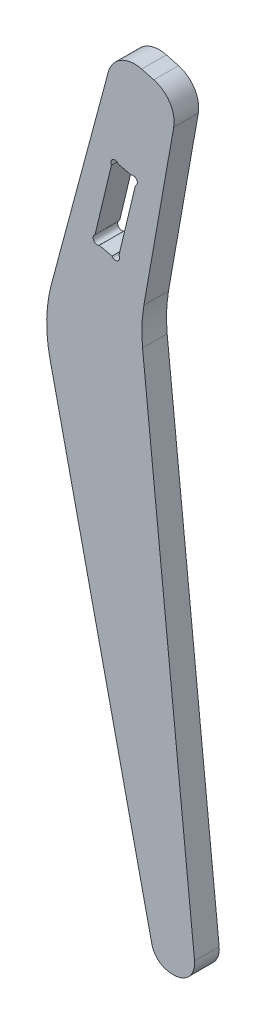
ISO-10303-21;
HEADER;
FILE_DESCRIPTION(('STEP AP214'),'2;1');
FILE_NAME('part.step','',(''),(''),'','','');
FILE_SCHEMA(('AUTOMOTIVE_DESIGN { 1 0 10303 214 1 1 1 1 }'));
ENDSEC;
DATA;
#1=APPLICATION_CONTEXT('core data for automotive mechanical design processes');
#2=APPLICATION_PROTOCOL_DEFINITION('international standard','automotive_design',2000,#1);
#3=PRODUCT_CONTEXT('',#1,'mechanical');
#4=PRODUCT('Part','Part','',(#3));
#5=PRODUCT_RELATED_PRODUCT_CATEGORY('part','',(#4));
#6=PRODUCT_DEFINITION_FORMATION('','',#4);
#7=PRODUCT_DEFINITION_CONTEXT('part definition',#1,'design');
#8=PRODUCT_DEFINITION('design','',#6,#7);
#9=PRODUCT_DEFINITION_SHAPE('','',#8);
#10=(LENGTH_UNIT() NAMED_UNIT(*) SI_UNIT(.MILLI.,.METRE.));
#11=(NAMED_UNIT(*) PLANE_ANGLE_UNIT() SI_UNIT($,.RADIAN.));
#12=(NAMED_UNIT(*) SI_UNIT($,.STERADIAN.) SOLID_ANGLE_UNIT());
#13=UNCERTAINTY_MEASURE_WITH_UNIT(LENGTH_MEASURE(1.E-05),#10,'distance_accuracy_value','');
#14=(GEOMETRIC_REPRESENTATION_CONTEXT(3) GLOBAL_UNCERTAINTY_ASSIGNED_CONTEXT((#13)) GLOBAL_UNIT_ASSIGNED_CONTEXT((#10,
#11,#12)) REPRESENTATION_CONTEXT('',''));
#15=CARTESIAN_POINT('',(0.,0.,0.));
#16=DIRECTION('',(0.,0.,1.));
#17=DIRECTION('',(1.,0.,0.));
#18=AXIS2_PLACEMENT_3D('',#15,#16,#17);
#19=CARTESIAN_POINT('',(41.8004742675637,156.001493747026,18.));
#20=DIRECTION('',(0.258819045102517,0.965925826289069,0.));
#21=DIRECTION('',(-0.965925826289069,0.258819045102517,0.));
#22=AXIS2_PLACEMENT_3D('',#19,#20,#21);
#23=PLANE('',#22);
#24=DIRECTION('',(0.965925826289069,-0.258819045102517,0.));
#25=VECTOR('',#24,1.);
#26=CARTESIAN_POINT('',(41.8004742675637,156.001493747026,0.));
#27=LINE('',#26,#25);
#28=CARTESIAN_POINT('',(213.825932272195,109.907411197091,0.));
#29=VERTEX_POINT('',#28);
#30=CARTESIAN_POINT('',(222.668724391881,107.537992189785,0.));
#31=VERTEX_POINT('',#30);
#32=EDGE_CURVE('E216',#29,#31,#27,.T.);
#33=ORIENTED_EDGE('',*,*,#32,.F.);
#34=DIRECTION('',(0.,0.,-1.));
#35=VECTOR('',#34,1.);
#36=CARTESIAN_POINT('',(213.825932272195,109.907411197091,18.));
#37=LINE('',#36,#35);
#38=CARTESIAN_POINT('',(213.825932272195,109.907411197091,18.));
#39=VERTEX_POINT('',#38);
#40=EDGE_CURVE('E246',#39,#29,#37,.T.);
#41=ORIENTED_EDGE('',*,*,#40,.F.);
#42=DIRECTION('',(0.965925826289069,-0.258819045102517,0.));
#43=VECTOR('',#42,1.);
#44=CARTESIAN_POINT('',(41.8004742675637,156.001493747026,18.));
#45=LINE('',#44,#43);
#46=CARTESIAN_POINT('',(222.668724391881,107.537992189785,18.));
#47=VERTEX_POINT('',#46);
#48=EDGE_CURVE('E329',#39,#47,#45,.T.);
#49=ORIENTED_EDGE('',*,*,#48,.T.);
#50=DIRECTION('',(0.,0.,-1.));
#51=VECTOR('',#50,1.);
#52=CARTESIAN_POINT('',(222.668724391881,107.537992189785,18.));
#53=LINE('',#52,#51);
#54=EDGE_CURVE('E239',#47,#31,#53,.T.);
#55=ORIENTED_EDGE('',*,*,#54,.T.);
#56=EDGE_LOOP('',(#33,#41,#49,#55));
#57=FACE_BOUND('',#56,.T.);
#58=ADVANCED_FACE('F35',(#57),#23,.T.);
#59=CARTESIAN_POINT('',(208.649551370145,90.5888946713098,18.));
#60=DIRECTION('',(0.,0.,-1.));
#61=DIRECTION('',(-1.,0.,0.));
#62=AXIS2_PLACEMENT_3D('',#59,#60,#61);
#63=CYLINDRICAL_SURFACE('',#62,20.);
#64=CARTESIAN_POINT('',(208.649551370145,90.5888946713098,0.));
#65=DIRECTION('',(0.,0.,1.));
#66=DIRECTION('',(1.,0.,0.));
#67=AXIS2_PLACEMENT_3D('',#64,#65,#66);
#68=CIRCLE('',#67,20.);
#69=CARTESIAN_POINT('',(189.331034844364,95.7652755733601,0.));
#70=VERTEX_POINT('',#69);
#71=EDGE_CURVE('E219',#29,#70,#68,.T.);
#72=ORIENTED_EDGE('',*,*,#71,.T.);
#73=DIRECTION('',(0.,0.,-1.));
#74=VECTOR('',#73,1.);
#75=CARTESIAN_POINT('',(189.331034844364,95.7652755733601,18.));
#76=LINE('',#75,#74);
#77=CARTESIAN_POINT('',(189.331034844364,95.7652755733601,18.));
#78=VERTEX_POINT('',#77);
#79=EDGE_CURVE('E243',#78,#70,#76,.T.);
#80=ORIENTED_EDGE('',*,*,#79,.F.);
#81=CARTESIAN_POINT('',(208.649551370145,90.5888946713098,18.));
#82=DIRECTION('',(0.,0.,1.));
#83=DIRECTION('',(1.,0.,0.));
#84=AXIS2_PLACEMENT_3D('',#81,#82,#83);
#85=CIRCLE('',#84,20.);
#86=EDGE_CURVE('E346',#39,#78,#85,.T.);
#87=ORIENTED_EDGE('',*,*,#86,.F.);
#88=ORIENTED_EDGE('',*,*,#40,.T.);
#89=EDGE_LOOP('',(#72,#80,#87,#88));
#90=FACE_BOUND('',#89,.T.);
#91=ADVANCED_FACE('F323',(#90),#63,.T.);
#92=CARTESIAN_POINT('',(152.70694147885,-40.917701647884,18.));
#93=DIRECTION('',(0.965925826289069,-0.258819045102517,0.));
#94=DIRECTION('',(0.258819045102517,0.965925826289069,0.));
#95=AXIS2_PLACEMENT_3D('',#92,#93,#94);
#96=PLANE('',#95);
#97=DIRECTION('',(-0.258819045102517,-0.965925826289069,0.));
#98=VECTOR('',#97,1.);
#99=CARTESIAN_POINT('',(152.70694147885,-40.917701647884,0.));
#100=LINE('',#99,#98);
#101=CARTESIAN_POINT('',(147.725808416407,-59.5075433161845,0.));
#102=VERTEX_POINT('',#101);
#103=EDGE_CURVE('E222',#70,#102,#100,.T.);
#104=ORIENTED_EDGE('',*,*,#103,.T.);
#105=DIRECTION('',(0.,0.,-1.));
#106=VECTOR('',#105,1.);
#107=CARTESIAN_POINT('',(147.725808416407,-59.5075433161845,18.));
#108=LINE('',#107,#106);
#109=CARTESIAN_POINT('',(147.725808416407,-59.5075433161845,18.));
#110=VERTEX_POINT('',#109);
#111=EDGE_CURVE('E253',#102,#110,#108,.F.);
#112=ORIENTED_EDGE('',*,*,#111,.T.);
#113=DIRECTION('',(-0.258819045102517,-0.965925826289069,0.));
#114=VECTOR('',#113,1.);
#115=CARTESIAN_POINT('',(152.70694147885,-40.917701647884,18.));
#116=LINE('',#115,#114);
#117=EDGE_CURVE('E319',#78,#110,#116,.T.);
#118=ORIENTED_EDGE('',*,*,#117,.F.);
#119=ORIENTED_EDGE('',*,*,#79,.T.);
#120=EDGE_LOOP('',(#104,#112,#118,#119));
#121=FACE_BOUND('',#120,.T.);
#122=ADVANCED_FACE('F316',(#121),#96,.F.);
#123=CARTESIAN_POINT('',(116.93444675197,26.1283123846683,18.));
#124=DIRECTION('',(-0.975933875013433,-0.218066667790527,0.));
#125=DIRECTION('',(0.218066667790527,-0.975933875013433,0.));
#126=AXIS2_PLACEMENT_3D('',#123,#124,#125);
#127=PLANE('',#126);
#128=DIRECTION('',(-0.218066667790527,0.975933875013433,0.));
#129=VECTOR('',#128,1.);
#130=CARTESIAN_POINT('',(116.93444675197,26.1283123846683,0.));
#131=LINE('',#130,#129);
#132=CARTESIAN_POINT('',(221.1771415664,-440.39863610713,0.));
#133=VERTEX_POINT('',#132);
#134=CARTESIAN_POINT('',(146.725003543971,-107.196114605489,0.));
#135=VERTEX_POINT('',#134);
#136=EDGE_CURVE('E225',#133,#135,#131,.T.);
#137=ORIENTED_EDGE('',*,*,#136,.F.);
#138=DIRECTION('',(0.,0.,-1.));
#139=VECTOR('',#138,1.);
#140=CARTESIAN_POINT('',(221.1771415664,-440.39863610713,18.));
#141=LINE('',#140,#139);
#142=CARTESIAN_POINT('',(221.1771415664,-440.39863610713,18.));
#143=VERTEX_POINT('',#142);
#144=EDGE_CURVE('E11',#133,#143,#141,.F.);
#145=ORIENTED_EDGE('',*,*,#144,.T.);
#146=DIRECTION('',(-0.218066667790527,0.975933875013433,0.));
#147=VECTOR('',#146,1.);
#148=CARTESIAN_POINT('',(116.93444675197,26.1283123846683,18.));
#149=LINE('',#148,#147);
#150=CARTESIAN_POINT('',(146.725003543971,-107.196114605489,18.));
#151=VERTEX_POINT('',#150);
#152=EDGE_CURVE('E309',#143,#151,#149,.T.);
#153=ORIENTED_EDGE('',*,*,#152,.T.);
#154=DIRECTION('',(0.,0.,-1.));
#155=VECTOR('',#154,1.);
#156=CARTESIAN_POINT('',(146.725003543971,-107.196114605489,0.));
#157=LINE('',#156,#155);
#158=EDGE_CURVE('E248',#151,#135,#157,.T.);
#159=ORIENTED_EDGE('',*,*,#158,.T.);
#160=EDGE_LOOP('',(#137,#145,#153,#159));
#161=FACE_BOUND('',#160,.T.);
#162=ADVANCED_FACE('F307',(#161),#127,.T.);
#163=CARTESIAN_POINT('',(0.,-452.127636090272,18.));
#164=DIRECTION('',(0.,-1.,0.));
#165=DIRECTION('',(0.,0.,-1.));
#166=AXIS2_PLACEMENT_3D('',#163,#164,#165);
#167=PLANE('',#166);
#168=DIRECTION('',(-1.,0.,0.));
#169=VECTOR('',#168,1.);
#170=CARTESIAN_POINT('',(0.,-452.127636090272,0.));
#171=LINE('',#170,#169);
#172=CARTESIAN_POINT('',(237.524308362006,-452.127636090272,0.));
#173=VERTEX_POINT('',#172);
#174=CARTESIAN_POINT('',(235.816149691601,-452.127636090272,0.));
#175=VERTEX_POINT('',#174);
#176=EDGE_CURVE('E227',#173,#175,#171,.T.);
#177=ORIENTED_EDGE('',*,*,#176,.F.);
#178=DIRECTION('',(0.,0.,-1.));
#179=VECTOR('',#178,1.);
#180=CARTESIAN_POINT('',(237.524308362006,-452.127636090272,18.));
#181=LINE('',#180,#179);
#182=CARTESIAN_POINT('',(237.524308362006,-452.127636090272,18.));
#183=VERTEX_POINT('',#182);
#184=EDGE_CURVE('E282',#173,#183,#181,.F.);
#185=ORIENTED_EDGE('',*,*,#184,.T.);
#186=DIRECTION('',(-1.,0.,0.));
#187=VECTOR('',#186,1.);
#188=CARTESIAN_POINT('',(0.,-452.127636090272,18.));
#189=LINE('',#188,#187);
#190=CARTESIAN_POINT('',(235.816149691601,-452.127636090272,18.));
#191=VERTEX_POINT('',#190);
#192=EDGE_CURVE('E290',#183,#191,#189,.T.);
#193=ORIENTED_EDGE('',*,*,#192,.T.);
#194=DIRECTION('',(0.,0.,-1.));
#195=VECTOR('',#194,1.);
#196=CARTESIAN_POINT('',(235.816149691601,-452.127636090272,18.));
#197=LINE('',#196,#195);
#198=EDGE_CURVE('E279',#191,#175,#197,.T.);
#199=ORIENTED_EDGE('',*,*,#198,.T.);
#200=EDGE_LOOP('',(#177,#185,#193,#199));
#201=FACE_BOUND('',#200,.T.);
#202=ADVANCED_FACE('F303',(#201),#167,.T.);
#203=CARTESIAN_POINT('',(205.380018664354,21.1630051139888,18.));
#204=DIRECTION('',(0.994732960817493,0.10250042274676,0.));
#205=DIRECTION('',(-0.10250042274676,0.994732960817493,0.));
#206=AXIS2_PLACEMENT_3D('',#203,#204,#205);
#207=PLANE('',#206);
#208=DIRECTION('',(0.10250042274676,-0.994732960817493,0.));
#209=VECTOR('',#208,1.);
#210=CARTESIAN_POINT('',(205.380018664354,21.1630051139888,18.));
#211=LINE('',#210,#209);
#212=CARTESIAN_POINT('',(214.406928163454,-66.4401888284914,18.));
#213=VERTEX_POINT('',#212);
#214=CARTESIAN_POINT('',(252.445302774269,-435.590129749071,18.));
#215=VERTEX_POINT('',#214);
#216=EDGE_CURVE('E288',#213,#215,#211,.T.);
#217=ORIENTED_EDGE('',*,*,#216,.T.);
#218=DIRECTION('',(0.,0.,-1.));
#219=VECTOR('',#218,1.);
#220=CARTESIAN_POINT('',(252.445302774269,-435.590129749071,18.));
#221=LINE('',#220,#219);
#222=CARTESIAN_POINT('',(252.445302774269,-435.590129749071,0.));
#223=VERTEX_POINT('',#222);
#224=EDGE_CURVE('E272',#215,#223,#221,.T.);
#225=ORIENTED_EDGE('',*,*,#224,.T.);
#226=DIRECTION('',(0.10250042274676,-0.994732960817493,0.));
#227=VECTOR('',#226,1.);
#228=CARTESIAN_POINT('',(205.380018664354,21.1630051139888,0.));
#229=LINE('',#228,#227);
#230=CARTESIAN_POINT('',(214.406928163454,-66.4401888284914,0.));
#231=VERTEX_POINT('',#230);
#232=EDGE_CURVE('E230',#231,#223,#229,.T.);
#233=ORIENTED_EDGE('',*,*,#232,.F.);
#234=DIRECTION('',(0.,0.,-1.));
#235=VECTOR('',#234,1.);
#236=CARTESIAN_POINT('',(214.406928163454,-66.4401888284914,18.));
#237=LINE('',#236,#235);
#238=EDGE_CURVE('E261',#231,#213,#237,.F.);
#239=ORIENTED_EDGE('',*,*,#238,.T.);
#240=EDGE_LOOP('',(#217,#225,#233,#239));
#241=FACE_BOUND('',#240,.T.);
#242=ADVANCED_FACE('F295',(#241),#207,.T.);
#243=CARTESIAN_POINT('',(215.543883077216,-38.0062021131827,18.));
#244=DIRECTION('',(0.984807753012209,-0.173648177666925,0.));
#245=DIRECTION('',(0.173648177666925,0.984807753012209,0.));
#246=AXIS2_PLACEMENT_3D('',#243,#244,#245);
#247=PLANE('',#246);
#248=DIRECTION('',(-0.173648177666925,-0.984807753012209,0.));
#249=VECTOR('',#248,1.);
#250=CARTESIAN_POINT('',(215.543883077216,-38.0062021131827,18.));
#251=LINE('',#250,#249);
#252=CARTESIAN_POINT('',(237.188498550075,84.7465121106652,18.));
#253=VERTEX_POINT('',#252);
#254=CARTESIAN_POINT('',(215.399448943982,-38.8253287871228,18.));
#255=VERTEX_POINT('',#254);
#256=EDGE_CURVE('E298',#253,#255,#251,.T.);
#257=ORIENTED_EDGE('',*,*,#256,.T.);
#258=DIRECTION('',(0.,0.,-1.));
#259=VECTOR('',#258,1.);
#260=CARTESIAN_POINT('',(215.399448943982,-38.8253287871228,0.));
#261=LINE('',#260,#259);
#262=CARTESIAN_POINT('',(215.399448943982,-38.8253287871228,0.));
#263=VERTEX_POINT('',#262);
#264=EDGE_CURVE('E258',#255,#263,#261,.T.);
#265=ORIENTED_EDGE('',*,*,#264,.T.);
#266=DIRECTION('',(-0.173648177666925,-0.984807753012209,0.));
#267=VECTOR('',#266,1.);
#268=CARTESIAN_POINT('',(215.543883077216,-38.0062021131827,0.));
#269=LINE('',#268,#267);
#270=CARTESIAN_POINT('',(237.188498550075,84.7465121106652,0.));
#271=VERTEX_POINT('',#270);
#272=EDGE_CURVE('E233',#271,#263,#269,.T.);
#273=ORIENTED_EDGE('',*,*,#272,.F.);
#274=DIRECTION('',(0.,0.,-1.));
#275=VECTOR('',#274,1.);
#276=CARTESIAN_POINT('',(237.188498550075,84.7465121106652,18.));
#277=LINE('',#276,#275);
#278=EDGE_CURVE('E241',#253,#271,#277,.T.);
#279=ORIENTED_EDGE('',*,*,#278,.F.);
#280=EDGE_LOOP('',(#257,#265,#273,#279));
#281=FACE_BOUND('',#280,.T.);
#282=ADVANCED_FACE('F337',(#281),#247,.T.);
#283=CARTESIAN_POINT('',(19.9991991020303,83.5068127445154,18.));
#284=DIRECTION('',(0.232905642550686,0.97249933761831,0.));
#285=DIRECTION('',(-0.97249933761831,0.232905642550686,0.));
#286=AXIS2_PLACEMENT_3D('',#283,#284,#285);
#287=PLANE('',#286);
#288=DIRECTION('',(0.97249933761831,-0.232905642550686,0.));
#289=VECTOR('',#288,1.);
#290=CARTESIAN_POINT('',(19.9991991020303,83.5068127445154,0.));
#291=LINE('',#290,#289);
#292=CARTESIAN_POINT('',(196.781458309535,41.1689066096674,0.));
#293=VERTEX_POINT('',#292);
#294=CARTESIAN_POINT('',(206.034515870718,38.9528749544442,0.));
#295=VERTEX_POINT('',#294);
#296=EDGE_CURVE('E190',#293,#295,#291,.T.);
#297=ORIENTED_EDGE('',*,*,#296,.T.);
#298=DIRECTION('',(0.,0.,1.));
#299=VECTOR('',#298,1.);
#300=CARTESIAN_POINT('',(206.034515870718,38.9528749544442,0.));
#301=LINE('',#300,#299);
#302=CARTESIAN_POINT('',(206.034515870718,38.9528749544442,18.));
#303=VERTEX_POINT('',#302);
#304=EDGE_CURVE('E367',#295,#303,#301,.T.);
#305=ORIENTED_EDGE('',*,*,#304,.T.);
#306=DIRECTION('',(0.97249933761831,-0.232905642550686,0.));
#307=VECTOR('',#306,1.);
#308=CARTESIAN_POINT('',(19.9991991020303,83.5068127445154,18.));
#309=LINE('',#308,#307);
#310=CARTESIAN_POINT('',(196.781458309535,41.1689066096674,18.));
#311=VERTEX_POINT('',#310);
#312=EDGE_CURVE('E192',#311,#303,#309,.T.);
#313=ORIENTED_EDGE('',*,*,#312,.F.);
#314=DIRECTION('',(0.,0.,1.));
#315=VECTOR('',#314,1.);
#316=CARTESIAN_POINT('',(196.781458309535,41.1689066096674,0.));
#317=LINE('',#316,#315);
#318=EDGE_CURVE('E174',#311,#293,#317,.F.);
#319=ORIENTED_EDGE('',*,*,#318,.T.);
#320=EDGE_LOOP('',(#297,#305,#313,#319));
#321=FACE_BOUND('',#320,.T.);
#322=ADVANCED_FACE('F188',(#321),#287,.F.);
#323=CARTESIAN_POINT('',(190.161282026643,-45.5420727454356,18.));
#324=DIRECTION('',(0.972499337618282,-0.232905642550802,0.));
#325=DIRECTION('',(0.232905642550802,0.972499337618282,0.));
#326=AXIS2_PLACEMENT_3D('',#323,#324,#325);
#327=PLANE('',#326);
#328=DIRECTION('',(-0.232905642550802,-0.972499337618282,0.));
#329=VECTOR('',#328,1.);
#330=CARTESIAN_POINT('',(190.161282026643,-45.5420727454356,0.));
#331=LINE('',#330,#329);
#332=CARTESIAN_POINT('',(209.172346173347,33.8387747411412,0.));
#333=VERTEX_POINT('',#332);
#334=CARTESIAN_POINT('',(197.174277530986,-16.2592550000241,0.));
#335=VERTEX_POINT('',#334);
#336=EDGE_CURVE('E199',#333,#335,#331,.T.);
#337=ORIENTED_EDGE('',*,*,#336,.T.);
#338=DIRECTION('',(0.,0.,1.));
#339=VECTOR('',#338,1.);
#340=CARTESIAN_POINT('',(197.174277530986,-16.2592550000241,0.));
#341=LINE('',#340,#339);
#342=CARTESIAN_POINT('',(197.174277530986,-16.2592550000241,18.));
#343=VERTEX_POINT('',#342);
#344=EDGE_CURVE('E361',#335,#343,#341,.T.);
#345=ORIENTED_EDGE('',*,*,#344,.T.);
#346=DIRECTION('',(-0.232905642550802,-0.972499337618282,0.));
#347=VECTOR('',#346,1.);
#348=CARTESIAN_POINT('',(190.161282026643,-45.5420727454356,18.));
#349=LINE('',#348,#347);
#350=CARTESIAN_POINT('',(209.172346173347,33.8387747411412,18.));
#351=VERTEX_POINT('',#350);
#352=EDGE_CURVE('E355',#351,#343,#349,.T.);
#353=ORIENTED_EDGE('',*,*,#352,.F.);
#354=DIRECTION('',(0.,0.,1.));
#355=VECTOR('',#354,1.);
#356=CARTESIAN_POINT('',(209.172346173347,33.8387747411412,0.));
#357=LINE('',#356,#355);
#358=EDGE_CURVE('E193',#351,#333,#357,.F.);
#359=ORIENTED_EDGE('',*,*,#358,.T.);
#360=EDGE_LOOP('',(#337,#345,#353,#359));
#361=FACE_BOUND('',#360,.T.);
#362=ADVANCED_FACE('F399',(#361),#327,.F.);
#363=CARTESIAN_POINT('',(6.02486054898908,25.1568524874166,18.));
#364=DIRECTION('',(0.232905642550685,0.97249933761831,0.));
#365=DIRECTION('',(-0.972499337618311,0.232905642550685,0.));
#366=AXIS2_PLACEMENT_3D('',#363,#364,#365);
#367=PLANE('',#366);
#368=DIRECTION('',(0.,0.,1.));
#369=VECTOR('',#368,1.);
#370=CARTESIAN_POINT('',(182.807119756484,-17.1810536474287,0.));
#371=LINE('',#370,#369);
#372=CARTESIAN_POINT('',(182.807119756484,-17.1810536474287,18.));
#373=VERTEX_POINT('',#372);
#374=CARTESIAN_POINT('',(182.807119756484,-17.1810536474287,0.));
#375=VERTEX_POINT('',#374);
#376=EDGE_CURVE('E200',#373,#375,#371,.F.);
#377=ORIENTED_EDGE('',*,*,#376,.F.);
#378=DIRECTION('',(0.972499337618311,-0.232905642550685,0.));
#379=VECTOR('',#378,1.);
#380=CARTESIAN_POINT('',(6.02486054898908,25.1568524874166,18.));
#381=LINE('',#380,#379);
#382=CARTESIAN_POINT('',(192.06017731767,-19.3970853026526,18.));
#383=VERTEX_POINT('',#382);
#384=EDGE_CURVE('E352',#373,#383,#381,.T.);
#385=ORIENTED_EDGE('',*,*,#384,.T.);
#386=DIRECTION('',(0.,0.,1.));
#387=VECTOR('',#386,1.);
#388=CARTESIAN_POINT('',(192.06017731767,-19.3970853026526,0.));
#389=LINE('',#388,#387);
#390=CARTESIAN_POINT('',(192.06017731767,-19.3970853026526,0.));
#391=VERTEX_POINT('',#390);
#392=EDGE_CURVE('E364',#391,#383,#389,.T.);
#393=ORIENTED_EDGE('',*,*,#392,.F.);
#394=DIRECTION('',(0.972499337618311,-0.232905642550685,0.));
#395=VECTOR('',#394,1.);
#396=CARTESIAN_POINT('',(6.02486054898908,25.1568524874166,0.));
#397=LINE('',#396,#395);
#398=EDGE_CURVE('E203',#375,#391,#397,.T.);
#399=ORIENTED_EDGE('',*,*,#398,.F.);
#400=EDGE_LOOP('',(#377,#385,#393,#399));
#401=FACE_BOUND('',#400,.T.);
#402=ADVANCED_FACE('F395',(#401),#367,.T.);
#403=CARTESIAN_POINT('',(172.656293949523,-41.34977117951,18.));
#404=DIRECTION('',(0.972499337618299,-0.232905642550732,0.));
#405=DIRECTION('',(0.232905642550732,0.972499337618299,0.));
#406=AXIS2_PLACEMENT_3D('',#403,#404,#405);
#407=PLANE('',#406);
#408=DIRECTION('',(0.,0.,1.));
#409=VECTOR('',#408,1.);
#410=CARTESIAN_POINT('',(179.669289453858,-12.0669534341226,0.));
#411=LINE('',#410,#409);
#412=CARTESIAN_POINT('',(179.669289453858,-12.0669534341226,0.));
#413=VERTEX_POINT('',#412);
#414=CARTESIAN_POINT('',(179.669289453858,-12.0669534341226,18.));
#415=VERTEX_POINT('',#414);
#416=EDGE_CURVE('E206',#413,#415,#411,.T.);
#417=ORIENTED_EDGE('',*,*,#416,.F.);
#418=DIRECTION('',(-0.232905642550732,-0.972499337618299,0.));
#419=VECTOR('',#418,1.);
#420=CARTESIAN_POINT('',(172.656293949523,-41.34977117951,0.));
#421=LINE('',#420,#419);
#422=CARTESIAN_POINT('',(191.667358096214,38.0310763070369,0.));
#423=VERTEX_POINT('',#422);
#424=EDGE_CURVE('E214',#423,#413,#421,.T.);
#425=ORIENTED_EDGE('',*,*,#424,.F.);
#426=DIRECTION('',(0.,0.,1.));
#427=VECTOR('',#426,1.);
#428=CARTESIAN_POINT('',(191.667358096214,38.0310763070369,0.));
#429=LINE('',#428,#427);
#430=CARTESIAN_POINT('',(191.667358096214,38.0310763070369,18.));
#431=VERTEX_POINT('',#430);
#432=EDGE_CURVE('E177',#431,#423,#429,.F.);
#433=ORIENTED_EDGE('',*,*,#432,.F.);
#434=DIRECTION('',(-0.232905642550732,-0.972499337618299,0.));
#435=VECTOR('',#434,1.);
#436=CARTESIAN_POINT('',(172.656293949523,-41.34977117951,18.));
#437=LINE('',#436,#435);
#438=EDGE_CURVE('E349',#431,#415,#437,.T.);
#439=ORIENTED_EDGE('',*,*,#438,.T.);
#440=EDGE_LOOP('',(#417,#425,#433,#439));
#441=FACE_BOUND('',#440,.T.);
#442=ADVANCED_FACE('F387',(#441),#407,.T.);
#443=CARTESIAN_POINT('',(217.492343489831,88.2194756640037,18.));
#444=DIRECTION('',(0.,0.,-1.));
#445=DIRECTION('',(-1.,0.,0.));
#446=AXIS2_PLACEMENT_3D('',#443,#444,#445);
#447=CYLINDRICAL_SURFACE('',#446,20.);
#448=CARTESIAN_POINT('',(217.492343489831,88.2194756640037,0.));
#449=DIRECTION('',(0.,0.,1.));
#450=DIRECTION('',(1.,0.,0.));
#451=AXIS2_PLACEMENT_3D('',#448,#449,#450);
#452=CIRCLE('',#451,20.);
#453=EDGE_CURVE('E236',#31,#271,#452,.F.);
#454=ORIENTED_EDGE('',*,*,#453,.F.);
#455=ORIENTED_EDGE('',*,*,#54,.F.);
#456=CARTESIAN_POINT('',(217.492343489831,88.2194756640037,18.));
#457=DIRECTION('',(0.,0.,1.));
#458=DIRECTION('',(1.,0.,0.));
#459=AXIS2_PLACEMENT_3D('',#456,#457,#458);
#460=CIRCLE('',#459,20.);
#461=EDGE_CURVE('E209',#47,#253,#460,.F.);
#462=ORIENTED_EDGE('',*,*,#461,.T.);
#463=ORIENTED_EDGE('',*,*,#278,.T.);
#464=EDGE_LOOP('',(#454,#455,#462,#463));
#465=FACE_BOUND('',#464,.T.);
#466=ADVANCED_FACE('F333',(#465),#447,.T.);
#467=CARTESIAN_POINT('',(0.,0.,18.));
#468=DIRECTION('',(0.,0.,1.));
#469=DIRECTION('',(1.,0.,0.));
#470=AXIS2_PLACEMENT_3D('',#467,#468,#469);
#471=PLANE('',#470);
#472=CARTESIAN_POINT('',(181.238204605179,-14.6240035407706,18.));
#473=DIRECTION('',(0.,0.,1.));
#474=DIRECTION('',(-1.,0.,0.));
#475=AXIS2_PLACEMENT_3D('',#472,#473,#474);
#476=CIRCLE('',#475,2.99999999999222);
#477=EDGE_CURVE('E375',#415,#373,#476,.T.);
#478=ORIENTED_EDGE('',*,*,#477,.F.);
#479=ORIENTED_EDGE('',*,*,#438,.F.);
#480=CARTESIAN_POINT('',(194.224408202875,39.599991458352,18.));
#481=DIRECTION('',(0.,0.,1.));
#482=DIRECTION('',(1.,0.,0.));
#483=AXIS2_PLACEMENT_3D('',#480,#481,#482);
#484=CIRCLE('',#483,2.9999999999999);
#485=EDGE_CURVE('E372',#311,#431,#484,.T.);
#486=ORIENTED_EDGE('',*,*,#485,.F.);
#487=ORIENTED_EDGE('',*,*,#312,.T.);
#488=CARTESIAN_POINT('',(207.603431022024,36.3958248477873,18.));
#489=DIRECTION('',(0.,0.,1.));
#490=DIRECTION('',(-1.,0.,0.));
#491=AXIS2_PLACEMENT_3D('',#488,#489,#490);
#492=CIRCLE('',#491,2.99999999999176);
#493=EDGE_CURVE('E374',#351,#303,#492,.T.);
#494=ORIENTED_EDGE('',*,*,#493,.F.);
#495=ORIENTED_EDGE('',*,*,#352,.T.);
#496=CARTESIAN_POINT('',(194.617227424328,-17.8281701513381,18.));
#497=DIRECTION('',(0.,0.,1.));
#498=DIRECTION('',(1.,0.,0.));
#499=AXIS2_PLACEMENT_3D('',#496,#497,#498);
#500=CIRCLE('',#499,2.99999999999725);
#501=EDGE_CURVE('E377',#383,#343,#500,.T.);
#502=ORIENTED_EDGE('',*,*,#501,.F.);
#503=ORIENTED_EDGE('',*,*,#384,.F.);
#504=EDGE_LOOP('',(#478,#479,#486,#487,#494,#495,#502,#503));
#505=FACE_BOUND('',#504,.T.);
#506=ORIENTED_EDGE('',*,*,#192,.F.);
#507=CARTESIAN_POINT('',(237.524308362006,-437.127636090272,18.));
#508=DIRECTION('',(0.,0.,1.));
#509=DIRECTION('',(1.,0.,0.));
#510=AXIS2_PLACEMENT_3D('',#507,#508,#509);
#511=CIRCLE('',#510,15.);
#512=EDGE_CURVE('E43',#183,#215,#511,.T.);
#513=ORIENTED_EDGE('',*,*,#512,.T.);
#514=ORIENTED_EDGE('',*,*,#216,.F.);
#515=CARTESIAN_POINT('',(313.880224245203,-56.1901465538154,18.));
#516=DIRECTION('',(0.,0.,1.));
#517=DIRECTION('',(1.,0.,0.));
#518=AXIS2_PLACEMENT_3D('',#515,#516,#517);
#519=CIRCLE('',#518,100.);
#520=EDGE_CURVE('E183',#213,#255,#519,.F.);
#521=ORIENTED_EDGE('',*,*,#520,.T.);
#522=ORIENTED_EDGE('',*,*,#256,.F.);
#523=ORIENTED_EDGE('',*,*,#461,.F.);
#524=ORIENTED_EDGE('',*,*,#48,.F.);
#525=ORIENTED_EDGE('',*,*,#86,.T.);
#526=ORIENTED_EDGE('',*,*,#117,.T.);
#527=CARTESIAN_POINT('',(244.318391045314,-85.3894478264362,18.));
#528=DIRECTION('',(0.,0.,1.));
#529=DIRECTION('',(1.,0.,0.));
#530=AXIS2_PLACEMENT_3D('',#527,#528,#529);
#531=CIRCLE('',#530,100.);
#532=EDGE_CURVE('E255',#110,#151,#531,.T.);
#533=ORIENTED_EDGE('',*,*,#532,.T.);
#534=ORIENTED_EDGE('',*,*,#152,.F.);
#535=CARTESIAN_POINT('',(235.816149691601,-437.127636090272,18.));
#536=DIRECTION('',(0.,0.,1.));
#537=DIRECTION('',(1.,0.,0.));
#538=AXIS2_PLACEMENT_3D('',#535,#536,#537);
#539=CIRCLE('',#538,15.);
#540=EDGE_CURVE('E55',#143,#191,#539,.T.);
#541=ORIENTED_EDGE('',*,*,#540,.T.);
#542=EDGE_LOOP('',(#506,#513,#514,#521,#522,#523,#524,#525,#526,#533,#534,#541));
#543=FACE_BOUND('',#542,.T.);
#544=ADVANCED_FACE('F287',(#505,#543),#471,.T.);
#545=CARTESIAN_POINT('',(0.,0.,0.));
#546=DIRECTION('',(0.,0.,1.));
#547=DIRECTION('',(1.,0.,0.));
#548=AXIS2_PLACEMENT_3D('',#545,#546,#547);
#549=PLANE('',#548);
#550=ORIENTED_EDGE('',*,*,#424,.T.);
#551=CARTESIAN_POINT('',(181.238204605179,-14.6240035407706,0.));
#552=DIRECTION('',(0.,0.,1.));
#553=DIRECTION('',(1.,0.,0.));
#554=AXIS2_PLACEMENT_3D('',#551,#552,#553);
#555=CIRCLE('',#554,2.99999999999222);
#556=EDGE_CURVE('E270',#413,#375,#555,.T.);
#557=ORIENTED_EDGE('',*,*,#556,.T.);
#558=ORIENTED_EDGE('',*,*,#398,.T.);
#559=CARTESIAN_POINT('',(194.617227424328,-17.8281701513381,0.));
#560=DIRECTION('',(0.,0.,1.));
#561=DIRECTION('',(1.,0.,0.));
#562=AXIS2_PLACEMENT_3D('',#559,#560,#561);
#563=CIRCLE('',#562,2.99999999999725);
#564=EDGE_CURVE('E267',#391,#335,#563,.T.);
#565=ORIENTED_EDGE('',*,*,#564,.T.);
#566=ORIENTED_EDGE('',*,*,#336,.F.);
#567=CARTESIAN_POINT('',(207.603431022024,36.3958248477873,0.));
#568=DIRECTION('',(0.,0.,1.));
#569=DIRECTION('',(1.,0.,0.));
#570=AXIS2_PLACEMENT_3D('',#567,#568,#569);
#571=CIRCLE('',#570,2.99999999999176);
#572=EDGE_CURVE('E182',#333,#295,#571,.T.);
#573=ORIENTED_EDGE('',*,*,#572,.T.);
#574=ORIENTED_EDGE('',*,*,#296,.F.);
#575=CARTESIAN_POINT('',(194.224408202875,39.599991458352,0.));
#576=DIRECTION('',(0.,0.,1.));
#577=DIRECTION('',(1.,0.,0.));
#578=AXIS2_PLACEMENT_3D('',#575,#576,#577);
#579=CIRCLE('',#578,2.9999999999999);
#580=EDGE_CURVE('E171',#293,#423,#579,.T.);
#581=ORIENTED_EDGE('',*,*,#580,.T.);
#582=EDGE_LOOP('',(#550,#557,#558,#565,#566,#573,#574,#581));
#583=FACE_BOUND('',#582,.T.);
#584=ORIENTED_EDGE('',*,*,#232,.T.);
#585=CARTESIAN_POINT('',(237.524308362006,-437.127636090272,0.));
#586=DIRECTION('',(0.,0.,1.));
#587=DIRECTION('',(1.,0.,0.));
#588=AXIS2_PLACEMENT_3D('',#585,#586,#587);
#589=CIRCLE('',#588,15.);
#590=EDGE_CURVE('E277',#223,#173,#589,.F.);
#591=ORIENTED_EDGE('',*,*,#590,.T.);
#592=ORIENTED_EDGE('',*,*,#176,.T.);
#593=CARTESIAN_POINT('',(235.816149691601,-437.127636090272,0.));
#594=DIRECTION('',(0.,0.,1.));
#595=DIRECTION('',(1.,0.,0.));
#596=AXIS2_PLACEMENT_3D('',#593,#594,#595);
#597=CIRCLE('',#596,15.);
#598=EDGE_CURVE('E275',#175,#133,#597,.F.);
#599=ORIENTED_EDGE('',*,*,#598,.T.);
#600=ORIENTED_EDGE('',*,*,#136,.T.);
#601=CARTESIAN_POINT('',(244.318391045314,-85.3894478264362,0.));
#602=DIRECTION('',(0.,0.,1.));
#603=DIRECTION('',(1.,0.,0.));
#604=AXIS2_PLACEMENT_3D('',#601,#602,#603);
#605=CIRCLE('',#604,100.);
#606=EDGE_CURVE('E251',#135,#102,#605,.F.);
#607=ORIENTED_EDGE('',*,*,#606,.T.);
#608=ORIENTED_EDGE('',*,*,#103,.F.);
#609=ORIENTED_EDGE('',*,*,#71,.F.);
#610=ORIENTED_EDGE('',*,*,#32,.T.);
#611=ORIENTED_EDGE('',*,*,#453,.T.);
#612=ORIENTED_EDGE('',*,*,#272,.T.);
#613=CARTESIAN_POINT('',(313.880224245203,-56.1901465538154,0.));
#614=DIRECTION('',(0.,0.,1.));
#615=DIRECTION('',(1.,0.,0.));
#616=AXIS2_PLACEMENT_3D('',#613,#614,#615);
#617=CIRCLE('',#616,100.);
#618=EDGE_CURVE('E263',#263,#231,#617,.T.);
#619=ORIENTED_EDGE('',*,*,#618,.T.);
#620=EDGE_LOOP('',(#584,#591,#592,#599,#600,#607,#608,#609,#610,#611,#612,#619));
#621=FACE_BOUND('',#620,.T.);
#622=ADVANCED_FACE('F196',(#583,#621),#549,.F.);
#623=CARTESIAN_POINT('',(244.318391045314,-85.3894478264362,18.));
#624=DIRECTION('',(0.,0.,1.));
#625=DIRECTION('',(1.,0.,0.));
#626=AXIS2_PLACEMENT_3D('',#623,#624,#625);
#627=CYLINDRICAL_SURFACE('',#626,100.);
#628=ORIENTED_EDGE('',*,*,#532,.F.);
#629=ORIENTED_EDGE('',*,*,#111,.F.);
#630=ORIENTED_EDGE('',*,*,#606,.F.);
#631=ORIENTED_EDGE('',*,*,#158,.F.);
#632=EDGE_LOOP('',(#628,#629,#630,#631));
#633=FACE_BOUND('',#632,.T.);
#634=ADVANCED_FACE('F312',(#633),#627,.T.);
#635=CARTESIAN_POINT('',(313.880224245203,-56.1901465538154,18.));
#636=DIRECTION('',(0.,0.,1.));
#637=DIRECTION('',(1.,0.,0.));
#638=AXIS2_PLACEMENT_3D('',#635,#636,#637);
#639=CYLINDRICAL_SURFACE('',#638,100.);
#640=ORIENTED_EDGE('',*,*,#520,.F.);
#641=ORIENTED_EDGE('',*,*,#238,.F.);
#642=ORIENTED_EDGE('',*,*,#618,.F.);
#643=ORIENTED_EDGE('',*,*,#264,.F.);
#644=EDGE_LOOP('',(#640,#641,#642,#643));
#645=FACE_BOUND('',#644,.T.);
#646=ADVANCED_FACE('F341',(#645),#639,.F.);
#647=CARTESIAN_POINT('',(194.224408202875,39.599991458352,0.));
#648=DIRECTION('',(0.,0.,1.));
#649=DIRECTION('',(1.,0.,0.));
#650=AXIS2_PLACEMENT_3D('',#647,#648,#649);
#651=CYLINDRICAL_SURFACE('',#650,2.9999999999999);
#652=ORIENTED_EDGE('',*,*,#485,.T.);
#653=ORIENTED_EDGE('',*,*,#432,.T.);
#654=ORIENTED_EDGE('',*,*,#580,.F.);
#655=ORIENTED_EDGE('',*,*,#318,.F.);
#656=EDGE_LOOP('',(#652,#653,#654,#655));
#657=FACE_BOUND('',#656,.T.);
#658=ADVANCED_FACE('F173',(#657),#651,.F.);
#659=CARTESIAN_POINT('',(207.603431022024,36.3958248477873,0.));
#660=DIRECTION('',(0.,0.,1.));
#661=DIRECTION('',(1.,0.,0.));
#662=AXIS2_PLACEMENT_3D('',#659,#660,#661);
#663=CYLINDRICAL_SURFACE('',#662,2.99999999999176);
#664=ORIENTED_EDGE('',*,*,#572,.F.);
#665=ORIENTED_EDGE('',*,*,#358,.F.);
#666=ORIENTED_EDGE('',*,*,#493,.T.);
#667=ORIENTED_EDGE('',*,*,#304,.F.);
#668=EDGE_LOOP('',(#664,#665,#666,#667));
#669=FACE_BOUND('',#668,.T.);
#670=ADVANCED_FACE('F381',(#669),#663,.F.);
#671=CARTESIAN_POINT('',(194.617227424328,-17.8281701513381,0.));
#672=DIRECTION('',(0.,0.,1.));
#673=DIRECTION('',(1.,0.,0.));
#674=AXIS2_PLACEMENT_3D('',#671,#672,#673);
#675=CYLINDRICAL_SURFACE('',#674,2.99999999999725);
#676=ORIENTED_EDGE('',*,*,#564,.F.);
#677=ORIENTED_EDGE('',*,*,#392,.T.);
#678=ORIENTED_EDGE('',*,*,#501,.T.);
#679=ORIENTED_EDGE('',*,*,#344,.F.);
#680=EDGE_LOOP('',(#676,#677,#678,#679));
#681=FACE_BOUND('',#680,.T.);
#682=ADVANCED_FACE('F397',(#681),#675,.F.);
#683=CARTESIAN_POINT('',(181.238204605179,-14.6240035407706,0.));
#684=DIRECTION('',(0.,0.,1.));
#685=DIRECTION('',(1.,0.,0.));
#686=AXIS2_PLACEMENT_3D('',#683,#684,#685);
#687=CYLINDRICAL_SURFACE('',#686,2.99999999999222);
#688=ORIENTED_EDGE('',*,*,#376,.T.);
#689=ORIENTED_EDGE('',*,*,#556,.F.);
#690=ORIENTED_EDGE('',*,*,#416,.T.);
#691=ORIENTED_EDGE('',*,*,#477,.T.);
#692=EDGE_LOOP('',(#688,#689,#690,#691));
#693=FACE_BOUND('',#692,.T.);
#694=ADVANCED_FACE('F391',(#693),#687,.F.);
#695=CARTESIAN_POINT('',(237.524308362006,-437.127636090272,18.));
#696=DIRECTION('',(0.,0.,-1.));
#697=DIRECTION('',(-1.,0.,0.));
#698=AXIS2_PLACEMENT_3D('',#695,#696,#697);
#699=CYLINDRICAL_SURFACE('',#698,15.);
#700=ORIENTED_EDGE('',*,*,#512,.F.);
#701=ORIENTED_EDGE('',*,*,#184,.F.);
#702=ORIENTED_EDGE('',*,*,#590,.F.);
#703=ORIENTED_EDGE('',*,*,#224,.F.);
#704=EDGE_LOOP('',(#700,#701,#702,#703));
#705=FACE_BOUND('',#704,.T.);
#706=ADVANCED_FACE('F300',(#705),#699,.T.);
#707=CARTESIAN_POINT('',(235.816149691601,-437.127636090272,18.));
#708=DIRECTION('',(0.,0.,-1.));
#709=DIRECTION('',(-1.,0.,0.));
#710=AXIS2_PLACEMENT_3D('',#707,#708,#709);
#711=CYLINDRICAL_SURFACE('',#710,15.);
#712=ORIENTED_EDGE('',*,*,#540,.F.);
#713=ORIENTED_EDGE('',*,*,#144,.F.);
#714=ORIENTED_EDGE('',*,*,#598,.F.);
#715=ORIENTED_EDGE('',*,*,#198,.F.);
#716=EDGE_LOOP('',(#712,#713,#714,#715));
#717=FACE_BOUND('',#716,.T.);
#718=ADVANCED_FACE('F37',(#717),#711,.T.);
#719=CLOSED_SHELL('',(#58,#91,#122,#162,#202,#242,#282,#322,#362,#402,#442,#466,#544,#622,#634,
#646,#658,#670,#682,#694,#706,#718));
#720=MANIFOLD_SOLID_BREP('B2',#719);
#721=ADVANCED_BREP_SHAPE_REPRESENTATION('',(#18,#720),#14);
#722=SHAPE_DEFINITION_REPRESENTATION(#9,#721);
ENDSEC;
END-ISO-10303-21;
